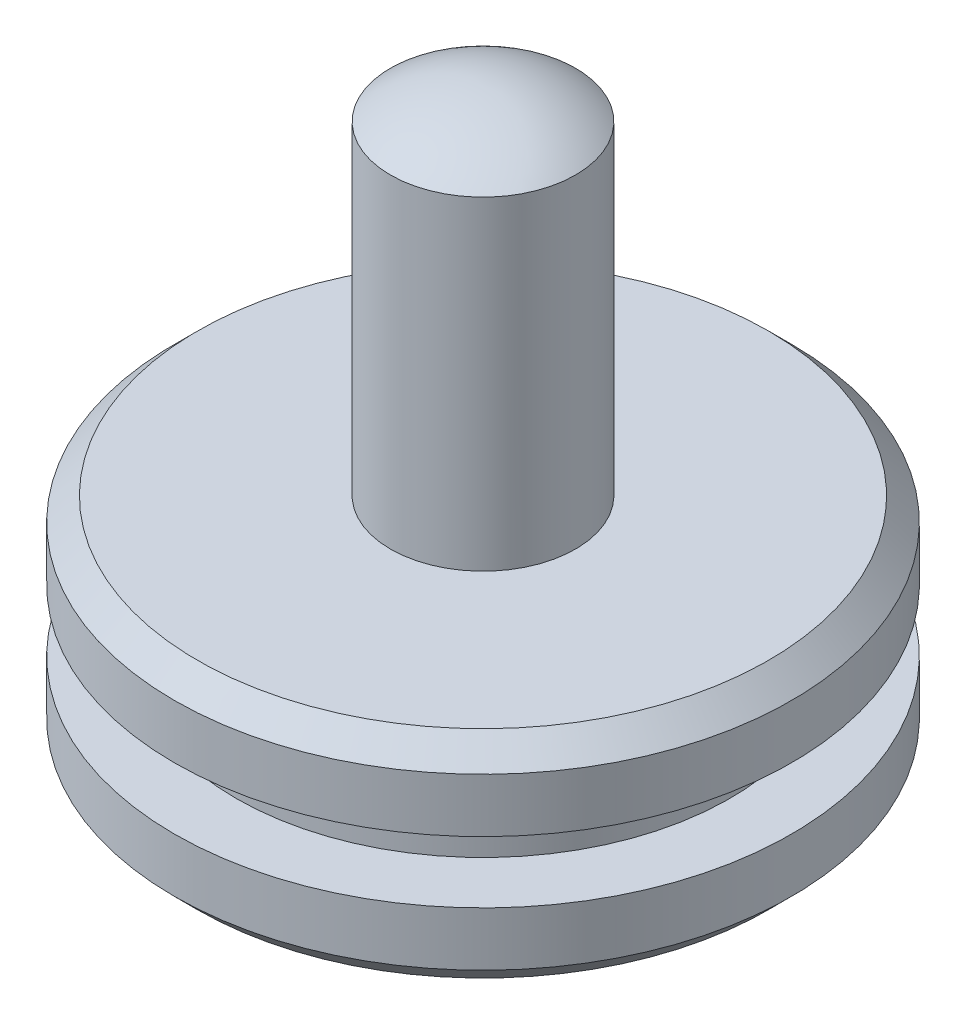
from build123d import *

# Parameters (mm, degrees)
CHANFREIN1_SIZE = 1.5


with BuildPart() as part:
    # Esquisse1 → Base-R_volution (revolve)
    with BuildSketch(Plane.XY, mode=Mode.PRIVATE) as base_r_volution_sk:
        with BuildLine():
            Line((6, 35), (6, 14))
            Line((6, 14), (20, 14))
            Line((20, 14), (20, 9))
            Line((20, 9), (16, 9))
            Line((16, 9), (16, 5))
            Line((16, 5), (20, 5))
            Line((20, 5), (20, 0))
            Line((20, 0), (0, 0))
            Line((0, 0), (0, 37))
            ThreePointArc((0, 37), (3.16227766, 36.486832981), (6, 35))
        make_face()
    revolve(base_r_volution_sk.sketch.rotate(Axis((0, 41, 0), (0, -1, 0)), 90), axis=Axis((0, 41, 0), (0, -1, 0)))

    # Chanfrein1
    chanfrein1_edges = [part.edges().sort_by_distance(p)[0] for p in [
        (0, 14, -20),
        (0, 0, -20),
    ]]
    chamfer(chanfrein1_edges, length=CHANFREIN1_SIZE)


solid = part.part
